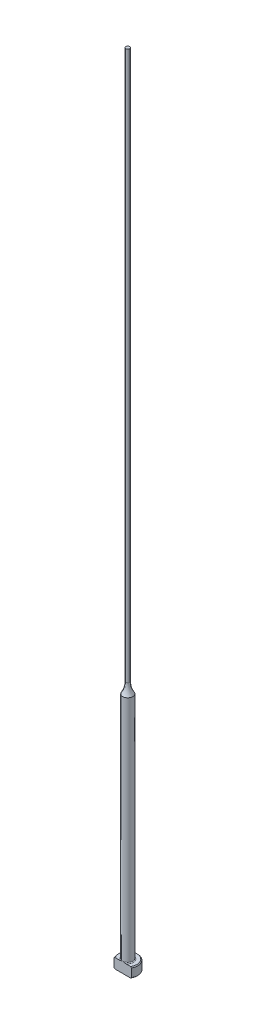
ISO-10303-21;
HEADER;
FILE_DESCRIPTION(('STEP AP214'),'2;1');
FILE_NAME('part.step','',(''),(''),'','','');
FILE_SCHEMA(('AUTOMOTIVE_DESIGN { 1 0 10303 214 1 1 1 1 }'));
ENDSEC;
DATA;
#1=APPLICATION_CONTEXT('core data for automotive mechanical design processes');
#2=APPLICATION_PROTOCOL_DEFINITION('international standard','automotive_design',2000,#1);
#3=PRODUCT_CONTEXT('',#1,'mechanical');
#4=PRODUCT('Part','Part','',(#3));
#5=PRODUCT_RELATED_PRODUCT_CATEGORY('part','',(#4));
#6=PRODUCT_DEFINITION_FORMATION('','',#4);
#7=PRODUCT_DEFINITION_CONTEXT('part definition',#1,'design');
#8=PRODUCT_DEFINITION('design','',#6,#7);
#9=PRODUCT_DEFINITION_SHAPE('','',#8);
#10=(LENGTH_UNIT() NAMED_UNIT(*) SI_UNIT(.MILLI.,.METRE.));
#11=(NAMED_UNIT(*) PLANE_ANGLE_UNIT() SI_UNIT($,.RADIAN.));
#12=(NAMED_UNIT(*) SI_UNIT($,.STERADIAN.) SOLID_ANGLE_UNIT());
#13=UNCERTAINTY_MEASURE_WITH_UNIT(LENGTH_MEASURE(1.E-05),#10,'distance_accuracy_value','');
#14=(GEOMETRIC_REPRESENTATION_CONTEXT(3) GLOBAL_UNCERTAINTY_ASSIGNED_CONTEXT((#13)) GLOBAL_UNIT_ASSIGNED_CONTEXT((#10,
#11,#12)) REPRESENTATION_CONTEXT('',''));
#15=CARTESIAN_POINT('',(0.,0.,0.));
#16=DIRECTION('',(0.,0.,1.));
#17=DIRECTION('',(1.,0.,0.));
#18=AXIS2_PLACEMENT_3D('',#15,#16,#17);
#19=CARTESIAN_POINT('',(-0.594359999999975,254.,0.));
#20=DIRECTION('',(0.,1.,0.));
#21=DIRECTION('',(0.,0.,1.));
#22=AXIS2_PLACEMENT_3D('',#19,#20,#21);
#23=PLANE('',#22);
#24=CARTESIAN_POINT('',(0.,254.,0.));
#25=DIRECTION('',(0.,1.,0.));
#26=DIRECTION('',(0.,0.,1.));
#27=AXIS2_PLACEMENT_3D('',#24,#25,#26);
#28=CIRCLE('',#27,0.594359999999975);
#29=CARTESIAN_POINT('',(0.,254.,0.594359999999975));
#30=VERTEX_POINT('',#29);
#31=EDGE_CURVE('E169',#30,#30,#28,.T.);
#32=ORIENTED_EDGE('',*,*,#31,.T.);
#33=EDGE_LOOP('',(#32));
#34=FACE_BOUND('',#33,.T.);
#35=ADVANCED_FACE('F37',(#34),#23,.T.);
#36=CARTESIAN_POINT('',(0.,259.958771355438,0.));
#37=DIRECTION('',(0.,1.,0.));
#38=DIRECTION('',(0.,0.,1.));
#39=AXIS2_PLACEMENT_3D('',#36,#37,#38);
#40=CYLINDRICAL_SURFACE('',#39,0.594359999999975);
#41=CARTESIAN_POINT('',(0.,79.6097728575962,0.));
#42=DIRECTION('',(0.,1.,0.));
#43=DIRECTION('',(0.,0.,1.));
#44=AXIS2_PLACEMENT_3D('',#41,#42,#43);
#45=CIRCLE('',#44,0.594359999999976);
#46=CARTESIAN_POINT('',(0.,79.6097728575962,0.594359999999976));
#47=VERTEX_POINT('',#46);
#48=EDGE_CURVE('E172',#47,#47,#45,.T.);
#49=ORIENTED_EDGE('',*,*,#48,.T.);
#50=EDGE_LOOP('',(#49));
#51=FACE_BOUND('',#50,.T.);
#52=ORIENTED_EDGE('',*,*,#31,.F.);
#53=EDGE_LOOP('',(#52));
#54=FACE_BOUND('',#53,.T.);
#55=ADVANCED_FACE('F160',(#51,#54),#40,.T.);
#56=CARTESIAN_POINT('',(0.,79.6097728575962,0.));
#57=DIRECTION('',(0.,1.,0.));
#58=DIRECTION('',(0.,0.,1.));
#59=AXIS2_PLACEMENT_3D('',#56,#57,#58);
#60=TOROIDAL_SURFACE('',#59,6.94435999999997,6.35);
#61=CARTESIAN_POINT('',(0.,76.2,0.));
#62=DIRECTION('',(0.,1.,0.));
#63=DIRECTION('',(0.,0.,1.));
#64=AXIS2_PLACEMENT_3D('',#61,#62,#63);
#65=CIRCLE('',#64,1.58749999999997);
#66=CARTESIAN_POINT('',(0.,76.2,1.58749999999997));
#67=VERTEX_POINT('',#66);
#68=EDGE_CURVE('E100',#67,#67,#65,.T.);
#69=ORIENTED_EDGE('',*,*,#68,.T.);
#70=EDGE_LOOP('',(#69));
#71=FACE_BOUND('',#70,.T.);
#72=ORIENTED_EDGE('',*,*,#48,.F.);
#73=EDGE_LOOP('',(#72));
#74=FACE_BOUND('',#73,.T.);
#75=ADVANCED_FACE('F165',(#71,#74),#60,.F.);
#76=CARTESIAN_POINT('',(0.,259.958771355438,0.));
#77=DIRECTION('',(0.,1.,0.));
#78=DIRECTION('',(0.,0.,1.));
#79=AXIS2_PLACEMENT_3D('',#76,#77,#78);
#80=CYLINDRICAL_SURFACE('',#79,1.58749999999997);
#81=CARTESIAN_POINT('',(0.,3.42900000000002,0.));
#82=DIRECTION('',(0.,1.,0.));
#83=DIRECTION('',(0.,0.,1.));
#84=AXIS2_PLACEMENT_3D('',#81,#82,#83);
#85=CIRCLE('',#84,1.58749999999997);
#86=CARTESIAN_POINT('',(0.,3.42900000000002,1.58749999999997));
#87=VERTEX_POINT('',#86);
#88=EDGE_CURVE('E109',#87,#87,#85,.T.);
#89=ORIENTED_EDGE('',*,*,#88,.T.);
#90=EDGE_LOOP('',(#89));
#91=FACE_BOUND('',#90,.T.);
#92=ORIENTED_EDGE('',*,*,#68,.F.);
#93=EDGE_LOOP('',(#92));
#94=FACE_BOUND('',#93,.T.);
#95=ADVANCED_FACE('F192',(#91,#94),#80,.T.);
#96=CARTESIAN_POINT('',(-3.17499999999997,3.175,0.));
#97=DIRECTION('',(0.,1.,0.));
#98=DIRECTION('',(0.,0.,1.));
#99=AXIS2_PLACEMENT_3D('',#96,#97,#98);
#100=PLANE('',#99);
#101=DIRECTION('',(-1.,0.,0.));
#102=VECTOR('',#101,1.);
#103=CARTESIAN_POINT('',(-3.17499999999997,3.175,1.58749999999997));
#104=LINE('',#103,#102);
#105=CARTESIAN_POINT('',(2.45195529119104,3.175,1.58749999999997));
#106=VERTEX_POINT('',#105);
#107=CARTESIAN_POINT('',(0.933255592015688,3.175,1.58749999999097));
#108=VERTEX_POINT('',#107);
#109=EDGE_CURVE('E58',#106,#108,#104,.T.);
#110=ORIENTED_EDGE('',*,*,#109,.F.);
#111=CARTESIAN_POINT('',(0.,3.175,0.));
#112=DIRECTION('',(0.,1.,0.));
#113=DIRECTION('',(0.,0.,1.));
#114=AXIS2_PLACEMENT_3D('',#111,#112,#113);
#115=CIRCLE('',#114,2.92099999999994);
#116=CARTESIAN_POINT('',(-2.45195529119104,3.175,1.58749999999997));
#117=VERTEX_POINT('',#116);
#118=EDGE_CURVE('E171',#106,#117,#115,.T.);
#119=ORIENTED_EDGE('',*,*,#118,.T.);
#120=CARTESIAN_POINT('',(-0.933255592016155,3.17500000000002,1.58749999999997));
#121=VERTEX_POINT('',#120);
#122=EDGE_CURVE('E140',#121,#117,#104,.T.);
#123=ORIENTED_EDGE('',*,*,#122,.F.);
#124=CARTESIAN_POINT('',(0.,3.175,0.));
#125=DIRECTION('',(0.,1.,0.));
#126=DIRECTION('',(0.,0.,1.));
#127=AXIS2_PLACEMENT_3D('',#124,#125,#126);
#128=CIRCLE('',#127,1.84149999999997);
#129=EDGE_CURVE('E113',#121,#108,#128,.F.);
#130=ORIENTED_EDGE('',*,*,#129,.T.);
#131=EDGE_LOOP('',(#110,#119,#123,#130));
#132=FACE_BOUND('',#131,.T.);
#133=ADVANCED_FACE('F189',(#132),#100,.T.);
#134=CARTESIAN_POINT('',(0.,259.958771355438,0.));
#135=DIRECTION('',(0.,1.,0.));
#136=DIRECTION('',(0.,0.,1.));
#137=AXIS2_PLACEMENT_3D('',#134,#135,#136);
#138=CYLINDRICAL_SURFACE('',#137,3.17499999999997);
#139=DIRECTION('',(0.,-1.,0.));
#140=VECTOR('',#139,1.);
#141=CARTESIAN_POINT('',(-2.74963065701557,254.,1.58749999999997));
#142=LINE('',#141,#140);
#143=CARTESIAN_POINT('',(-2.74963065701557,2.92100000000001,1.58749999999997));
#144=VERTEX_POINT('',#143);
#145=CARTESIAN_POINT('',(-2.74963065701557,0.253999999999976,1.58749999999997));
#146=VERTEX_POINT('',#145);
#147=EDGE_CURVE('E95',#144,#146,#142,.T.);
#148=ORIENTED_EDGE('',*,*,#147,.F.);
#149=CARTESIAN_POINT('',(0.,2.92100000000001,0.));
#150=DIRECTION('',(0.,1.,0.));
#151=DIRECTION('',(0.,0.,1.));
#152=AXIS2_PLACEMENT_3D('',#149,#150,#151);
#153=CIRCLE('',#152,3.17499999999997);
#154=CARTESIAN_POINT('',(2.74963065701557,2.92100000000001,1.58749999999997));
#155=VERTEX_POINT('',#154);
#156=EDGE_CURVE('E110',#144,#155,#153,.F.);
#157=ORIENTED_EDGE('',*,*,#156,.T.);
#158=DIRECTION('',(0.,-1.,0.));
#159=VECTOR('',#158,1.);
#160=CARTESIAN_POINT('',(2.74963065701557,254.,1.58749999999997));
#161=LINE('',#160,#159);
#162=CARTESIAN_POINT('',(2.74963065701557,0.253999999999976,1.58749999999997));
#163=VERTEX_POINT('',#162);
#164=EDGE_CURVE('E182',#155,#163,#161,.T.);
#165=ORIENTED_EDGE('',*,*,#164,.T.);
#166=CARTESIAN_POINT('',(0.,0.253999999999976,0.));
#167=DIRECTION('',(0.,-1.,0.));
#168=DIRECTION('',(0.,0.,-1.));
#169=AXIS2_PLACEMENT_3D('',#166,#167,#168);
#170=CIRCLE('',#169,3.17499999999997);
#171=EDGE_CURVE('E116',#163,#146,#170,.F.);
#172=ORIENTED_EDGE('',*,*,#171,.T.);
#173=EDGE_LOOP('',(#148,#157,#165,#172));
#174=FACE_BOUND('',#173,.T.);
#175=ADVANCED_FACE('F180',(#174),#138,.T.);
#176=CARTESIAN_POINT('',(0.,0.,0.));
#177=DIRECTION('',(0.,-1.,0.));
#178=DIRECTION('',(0.,0.,-1.));
#179=AXIS2_PLACEMENT_3D('',#176,#177,#178);
#180=PLANE('',#179);
#181=DIRECTION('',(1.,0.,0.));
#182=VECTOR('',#181,1.);
#183=CARTESIAN_POINT('',(-2.74963065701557,0.,1.58749999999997));
#184=LINE('',#183,#182);
#185=CARTESIAN_POINT('',(-2.45195529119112,0.,1.58749999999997));
#186=VERTEX_POINT('',#185);
#187=CARTESIAN_POINT('',(2.45195529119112,0.,1.58749999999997));
#188=VERTEX_POINT('',#187);
#189=EDGE_CURVE('E92',#186,#188,#184,.T.);
#190=ORIENTED_EDGE('',*,*,#189,.F.);
#191=CARTESIAN_POINT('',(0.,0.,0.));
#192=DIRECTION('',(0.,-1.,0.));
#193=DIRECTION('',(0.,0.,-1.));
#194=AXIS2_PLACEMENT_3D('',#191,#192,#193);
#195=CIRCLE('',#194,2.92100000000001);
#196=EDGE_CURVE('E106',#186,#188,#195,.T.);
#197=ORIENTED_EDGE('',*,*,#196,.T.);
#198=EDGE_LOOP('',(#190,#197));
#199=FACE_BOUND('',#198,.T.);
#200=ADVANCED_FACE('F105',(#199),#180,.T.);
#201=CARTESIAN_POINT('',(0.,3.17499999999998,0.));
#202=DIRECTION('',(0.,-1.,0.));
#203=DIRECTION('',(0.,0.,-1.));
#204=AXIS2_PLACEMENT_3D('',#201,#202,#203);
#205=CONICAL_SURFACE('',#204,2.92099999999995,0.785398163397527);
#206=CARTESIAN_POINT('',(2.75033065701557,2.9203937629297,1.58749999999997));
#207=CARTESIAN_POINT('',(2.66887796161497,2.99091042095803,1.58749999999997));
#208=CARTESIAN_POINT('',(2.58705989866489,3.0610138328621,1.58749999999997));
#209=CARTESIAN_POINT('',(2.42241022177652,3.20009957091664,1.58749999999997));
#210=CARTESIAN_POINT('',(2.33957813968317,3.26908134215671,1.58749999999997));
#211=CARTESIAN_POINT('',(2.17073968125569,3.40716024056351,1.58749999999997));
#212=CARTESIAN_POINT('',(2.08470440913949,3.47622217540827,1.58749999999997));
#213=CARTESIAN_POINT('',(1.91099881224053,3.61222325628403,1.58749999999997));
#214=CARTESIAN_POINT('',(1.82332890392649,3.67916293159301,1.58749999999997));
#215=CARTESIAN_POINT('',(1.64569223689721,3.8102066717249,1.58749999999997));
#216=CARTESIAN_POINT('',(1.55572245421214,3.8743066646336,1.58749999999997));
#217=CARTESIAN_POINT('',(1.37280394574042,3.99833089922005,1.58749999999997));
#218=CARTESIAN_POINT('',(1.27985285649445,4.05825170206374,1.58749999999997));
#219=CARTESIAN_POINT('',(1.09086561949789,4.17130826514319,1.58749999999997));
#220=CARTESIAN_POINT('',(0.994859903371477,4.22449421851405,1.58749999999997));
#221=CARTESIAN_POINT('',(0.798114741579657,4.32122233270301,1.58749999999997));
#222=CARTESIAN_POINT('',(0.697384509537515,4.36478238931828,1.58749999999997));
#223=CARTESIAN_POINT('',(0.541185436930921,4.41951656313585,1.58749999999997));
#224=CARTESIAN_POINT('',(0.487627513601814,4.43611950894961,1.58749999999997));
#225=CARTESIAN_POINT('',(0.379267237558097,4.46466012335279,1.58749999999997));
#226=CARTESIAN_POINT('',(0.324465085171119,4.4765985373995,1.58749999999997));
#227=CARTESIAN_POINT('',(0.214272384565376,4.49501904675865,1.58749999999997));
#228=CARTESIAN_POINT('',(0.158887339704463,4.50153345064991,1.58749999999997));
#229=CARTESIAN_POINT('',(0.047736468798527,4.5087502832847,1.58749999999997));
#230=CARTESIAN_POINT('',(-0.00802931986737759,4.50945327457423,1.58749999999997));
#231=CARTESIAN_POINT('',(-0.119372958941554,4.50499163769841,1.58749999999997));
#232=CARTESIAN_POINT('',(-0.174950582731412,4.49982147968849,1.58749999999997));
#233=CARTESIAN_POINT('',(-0.285312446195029,4.48399101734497,1.58749999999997));
#234=CARTESIAN_POINT('',(-0.340096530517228,4.4733296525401,1.58749999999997));
#235=CARTESIAN_POINT('',(-0.448865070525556,4.44711334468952,1.58749999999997));
#236=CARTESIAN_POINT('',(-0.502841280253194,4.43152477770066,1.58749999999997));
#237=CARTESIAN_POINT('',(-0.609429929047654,4.39628553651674,1.58749999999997));
#238=CARTESIAN_POINT('',(-0.662042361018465,4.37663484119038,1.58749999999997));
#239=CARTESIAN_POINT('',(-0.778129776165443,4.32902110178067,1.58749999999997));
#240=CARTESIAN_POINT('',(-0.841245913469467,4.30019026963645,1.58749999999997));
#241=CARTESIAN_POINT('',(-0.96559457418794,4.23868811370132,1.58749999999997));
#242=CARTESIAN_POINT('',(-1.02682597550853,4.20601455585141,1.58749999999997));
#243=CARTESIAN_POINT('',(-1.14774341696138,4.13769010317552,1.58749999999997));
#244=CARTESIAN_POINT('',(-1.20742632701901,4.10203371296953,1.58749999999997));
#245=CARTESIAN_POINT('',(-1.32539130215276,4.02846531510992,1.58749999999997));
#246=CARTESIAN_POINT('',(-1.38367308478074,3.99055285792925,1.58749999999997));
#247=CARTESIAN_POINT('',(-1.55734442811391,3.87382704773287,1.58749999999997));
#248=CARTESIAN_POINT('',(-1.6709584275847,3.79237897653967,1.58749999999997));
#249=CARTESIAN_POINT('',(-1.89475235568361,3.62521862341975,1.58749999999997));
#250=CARTESIAN_POINT('',(-2.00493591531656,3.53951111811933,1.58749999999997));
#251=CARTESIAN_POINT('',(-2.22248693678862,3.36554942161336,1.58749999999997));
#252=CARTESIAN_POINT('',(-2.32986450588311,3.27730782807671,1.58749999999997));
#253=CARTESIAN_POINT('',(-2.48909538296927,3.14389342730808,1.58749999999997));
#254=CARTESIAN_POINT('',(-2.54159338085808,3.09948435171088,1.58749999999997));
#255=CARTESIAN_POINT('',(-2.64622282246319,3.01024124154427,1.58749999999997));
#256=CARTESIAN_POINT('',(-2.69835428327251,2.96540722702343,1.58749999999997));
#257=CARTESIAN_POINT('',(-2.75033065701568,2.92039376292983,1.58749999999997));
#258=B_SPLINE_CURVE_WITH_KNOTS('',3,(#206,#207,#208,#209,#210,#211,#212,#213,#214,#215,#216,
#217,#218,#219,#220,#221,#222,#223,#224,#225,#226,#227,#228,#229,#230,#231,#232,#233,#234,#235,
#236,#237,#238,#239,#240,#241,#242,#243,#244,#245,#246,#247,#248,#249,#250,#251,#252,#253,#254,
#255,#256,#257),.UNSPECIFIED.,.F.,.F.,(4,2,2,2,2,2,2,2,2,2,2,2,2,2,2,2,2,2,2,2,2,2,2,2,2,4),(0.,
0.323216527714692,0.64658837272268,0.97753957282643,1.30840757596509,1.639735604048,
1.97133312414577,2.30029221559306,2.62863448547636,2.79668277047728,2.96470418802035,
3.13171746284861,3.29871457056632,3.46586904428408,3.63305581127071,3.80140905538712,
3.96976317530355,4.17775353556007,4.38586541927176,4.59436953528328,4.80291533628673,
5.22209642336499,5.64081759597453,6.0577303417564,6.26401477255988,6.47028951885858),.UNSPECIFIED.);
#259=EDGE_CURVE('E63',#155,#106,#258,.T.);
#260=ORIENTED_EDGE('',*,*,#259,.F.);
#261=ORIENTED_EDGE('',*,*,#156,.F.);
#262=EDGE_CURVE('E133',#117,#144,#258,.T.);
#263=ORIENTED_EDGE('',*,*,#262,.F.);
#264=ORIENTED_EDGE('',*,*,#118,.F.);
#265=EDGE_LOOP('',(#260,#261,#263,#264));
#266=FACE_BOUND('',#265,.T.);
#267=ADVANCED_FACE('F147',(#266),#205,.T.);
#268=CARTESIAN_POINT('',(0.,0.253999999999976,0.));
#269=DIRECTION('',(0.,1.,0.));
#270=DIRECTION('',(0.,0.,1.));
#271=AXIS2_PLACEMENT_3D('',#268,#269,#270);
#272=CONICAL_SURFACE('',#271,3.17499999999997,0.785398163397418);
#273=CARTESIAN_POINT('',(-2.75033065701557,0.254606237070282,1.58749999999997));
#274=CARTESIAN_POINT('',(-2.66887796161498,0.184089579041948,1.58749999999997));
#275=CARTESIAN_POINT('',(-2.58705989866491,0.113986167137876,1.58749999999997));
#276=CARTESIAN_POINT('',(-2.42241022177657,-0.0250995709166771,1.58749999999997));
#277=CARTESIAN_POINT('',(-2.33957813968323,-0.0940813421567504,1.58749999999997));
#278=CARTESIAN_POINT('',(-2.17073968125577,-0.232160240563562,1.58749999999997));
#279=CARTESIAN_POINT('',(-2.08470440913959,-0.301222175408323,1.58749999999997));
#280=CARTESIAN_POINT('',(-1.91099881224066,-0.437223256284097,1.58749999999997));
#281=CARTESIAN_POINT('',(-1.82332890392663,-0.50416293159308,1.58749999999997));
#282=CARTESIAN_POINT('',(-1.64569223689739,-0.635206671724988,1.58749999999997));
#283=CARTESIAN_POINT('',(-1.55572245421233,-0.699306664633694,1.58749999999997));
#284=CARTESIAN_POINT('',(-1.37280394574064,-0.823330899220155,1.58749999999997));
#285=CARTESIAN_POINT('',(-1.27985285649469,-0.883251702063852,1.58749999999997));
#286=CARTESIAN_POINT('',(-1.09086561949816,-0.996308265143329,1.58749999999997));
#287=CARTESIAN_POINT('',(-0.994859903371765,-1.0494942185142,1.58749999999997));
#288=CARTESIAN_POINT('',(-0.798114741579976,-1.14622233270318,1.58749999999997));
#289=CARTESIAN_POINT('',(-0.697384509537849,-1.18978238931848,1.58749999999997));
#290=CARTESIAN_POINT('',(-0.54118543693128,-1.24451656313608,1.58749999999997));
#291=CARTESIAN_POINT('',(-0.487627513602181,-1.26111950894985,1.58749999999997));
#292=CARTESIAN_POINT('',(-0.379267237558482,-1.28966012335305,1.58749999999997));
#293=CARTESIAN_POINT('',(-0.324465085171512,-1.30159853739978,1.58749999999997));
#294=CARTESIAN_POINT('',(-0.214272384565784,-1.32001904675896,1.58749999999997));
#295=CARTESIAN_POINT('',(-0.158887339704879,-1.32653345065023,1.58749999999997));
#296=CARTESIAN_POINT('',(-0.0477364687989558,-1.33375028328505,1.58749999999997));
#297=CARTESIAN_POINT('',(0.00802931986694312,-1.33445327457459,1.58749999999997));
#298=CARTESIAN_POINT('',(0.119372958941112,-1.32999163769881,1.58749999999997));
#299=CARTESIAN_POINT('',(0.174950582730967,-1.3248214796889,1.58749999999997));
#300=CARTESIAN_POINT('',(0.28531244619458,-1.30899101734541,1.58749999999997));
#301=CARTESIAN_POINT('',(0.340096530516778,-1.29832965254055,1.58749999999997));
#302=CARTESIAN_POINT('',(0.448865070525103,-1.27211334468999,1.58749999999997));
#303=CARTESIAN_POINT('',(0.50284128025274,-1.25652477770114,1.58749999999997));
#304=CARTESIAN_POINT('',(0.609429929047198,-1.22128553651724,1.58749999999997));
#305=CARTESIAN_POINT('',(0.662042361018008,-1.20163484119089,1.58749999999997));
#306=CARTESIAN_POINT('',(0.778129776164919,-1.15402110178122,1.58749999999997));
#307=CARTESIAN_POINT('',(0.841245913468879,-1.12519026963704,1.58749999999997));
#308=CARTESIAN_POINT('',(0.965594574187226,-1.06368811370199,1.58749999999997));
#309=CARTESIAN_POINT('',(1.02682597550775,-1.03101455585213,1.58749999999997));
#310=CARTESIAN_POINT('',(1.14774341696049,-0.962690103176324,1.58749999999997));
#311=CARTESIAN_POINT('',(1.20742632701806,-0.927033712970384,1.58749999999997));
#312=CARTESIAN_POINT('',(1.32539130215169,-0.85346531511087,1.58749999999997));
#313=CARTESIAN_POINT('',(1.38367308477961,-0.815552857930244,1.58749999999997));
#314=CARTESIAN_POINT('',(1.5573444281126,-0.698827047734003,1.58749999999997));
#315=CARTESIAN_POINT('',(1.67095842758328,-0.617378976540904,1.58749999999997));
#316=CARTESIAN_POINT('',(1.89475235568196,-0.45021862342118,1.58749999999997));
#317=CARTESIAN_POINT('',(2.0049359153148,-0.364511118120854,1.58749999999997));
#318=CARTESIAN_POINT('',(2.22248693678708,-0.19054942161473,1.58749999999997));
#319=CARTESIAN_POINT('',(2.3298645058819,-0.102307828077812,1.58749999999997));
#320=CARTESIAN_POINT('',(2.48909538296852,0.0311065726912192,1.58749999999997));
#321=CARTESIAN_POINT('',(2.54159338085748,0.0755156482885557,1.58749999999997));
#322=CARTESIAN_POINT('',(2.64622282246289,0.16475875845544,1.58749999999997));
#323=CARTESIAN_POINT('',(2.69835428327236,0.209592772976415,1.58749999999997));
#324=CARTESIAN_POINT('',(2.75033065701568,0.254606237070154,1.58749999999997));
#325=B_SPLINE_CURVE_WITH_KNOTS('',3,(#273,#274,#275,#276,#277,#278,#279,#280,#281,#282,#283,
#284,#285,#286,#287,#288,#289,#290,#291,#292,#293,#294,#295,#296,#297,#298,#299,#300,#301,#302,
#303,#304,#305,#306,#307,#308,#309,#310,#311,#312,#313,#314,#315,#316,#317,#318,#319,#320,#321,
#322,#323,#324),.UNSPECIFIED.,.F.,.F.,(4,2,2,2,2,2,2,2,2,2,2,2,2,2,2,2,2,2,2,2,2,2,2,2,2,4),(0.,
0.323216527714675,0.646588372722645,0.977539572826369,1.308407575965,1.63973560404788,
1.97133312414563,2.3002922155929,2.62863448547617,2.79668277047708,2.96470418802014,
3.13171746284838,3.29871457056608,3.46586904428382,3.63305581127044,3.80140905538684,
3.96976317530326,4.17775353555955,4.38586541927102,4.59436953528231,4.80291533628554,
5.22209642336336,5.64081759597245,6.05773034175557,6.26401477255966,6.47028951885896),.UNSPECIFIED.);
#326=EDGE_CURVE('E89',#146,#186,#325,.T.);
#327=ORIENTED_EDGE('',*,*,#326,.F.);
#328=ORIENTED_EDGE('',*,*,#171,.F.);
#329=EDGE_CURVE('E101',#188,#163,#325,.T.);
#330=ORIENTED_EDGE('',*,*,#329,.F.);
#331=ORIENTED_EDGE('',*,*,#196,.F.);
#332=EDGE_LOOP('',(#327,#328,#330,#331));
#333=FACE_BOUND('',#332,.T.);
#334=ADVANCED_FACE('F108',(#333),#272,.T.);
#335=CARTESIAN_POINT('',(0.,3.42900000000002,0.));
#336=DIRECTION('',(0.,1.,0.));
#337=DIRECTION('',(0.,0.,1.));
#338=AXIS2_PLACEMENT_3D('',#335,#336,#337);
#339=TOROIDAL_SURFACE('',#338,1.84149999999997,0.254);
#340=ORIENTED_EDGE('',*,*,#129,.F.);
#341=CARTESIAN_POINT('',(0.,3.42900000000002,1.58749999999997));
#342=CARTESIAN_POINT('',(-1.92205025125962E-10,3.42900057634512,1.58749999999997));
#343=CARTESIAN_POINT('',(-1.22611614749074E-07,3.42900115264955,1.58749999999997));
#344=CARTESIAN_POINT('',(-5.0967636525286E-07,3.42900226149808,1.58749999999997));
#345=CARTESIAN_POINT('',(-7.78176328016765E-07,3.42900279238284,1.58749999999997));
#346=CARTESIAN_POINT('',(-1.42307272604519E-06,3.42900385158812,1.58749999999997));
#347=CARTESIAN_POINT('',(-1.80713867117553E-06,3.42900437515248,1.58749999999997));
#348=CARTESIAN_POINT('',(-2.63494846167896E-06,3.4290053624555,1.58749999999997));
#349=CARTESIAN_POINT('',(-3.07814756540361E-06,3.42900582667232,1.58749999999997));
#350=CARTESIAN_POINT('',(-4.66897357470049E-06,3.4290073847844,1.58749999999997));
#351=CARTESIAN_POINT('',(-5.89404908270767E-06,3.42900840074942,1.58749999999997));
#352=CARTESIAN_POINT('',(-8.42427511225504E-06,3.42901020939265,1.58749999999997));
#353=CARTESIAN_POINT('',(-9.72480574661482E-06,3.42901100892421,1.58749999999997));
#354=CARTESIAN_POINT('',(-1.48060601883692E-05,3.42901401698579,1.58749999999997));
#355=CARTESIAN_POINT('',(-1.86838281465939E-05,3.42901606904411,1.58749999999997));
#356=CARTESIAN_POINT('',(-2.63261117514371E-05,3.42901942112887,1.58749999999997));
#357=CARTESIAN_POINT('',(-3.00687417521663E-05,3.42902077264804,1.58749999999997));
#358=CARTESIAN_POINT('',(-4.60276298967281E-05,3.42902652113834,1.58749999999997));
#359=CARTESIAN_POINT('',(-5.8247019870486E-05,3.4290308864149,1.58749999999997));
#360=CARTESIAN_POINT('',(-8.11070097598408E-05,3.42903788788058,1.58749999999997));
#361=CARTESIAN_POINT('',(-9.16953114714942E-05,3.42904068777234,1.58749999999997));
#362=CARTESIAN_POINT('',(-0.000168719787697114,3.4290628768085,1.58749999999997));
#363=CARTESIAN_POINT('',(-0.00023219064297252,3.42909118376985,1.58749999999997));
#364=CARTESIAN_POINT('',(-0.000479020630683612,3.42919723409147,1.58749999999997));
#365=CARTESIAN_POINT('',(-0.000664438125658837,3.42926834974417,1.58749999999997));
#366=CARTESIAN_POINT('',(-0.00138448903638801,3.42954862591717,1.58749999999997));
#367=CARTESIAN_POINT('',(-0.00191701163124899,3.42976473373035,1.58749999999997));
#368=CARTESIAN_POINT('',(-0.00409774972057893,3.43064550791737,1.58749999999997));
#369=CARTESIAN_POINT('',(-0.00574830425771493,3.43130231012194,1.58749999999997));
#370=CARTESIAN_POINT('',(-0.0289985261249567,3.44055947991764,1.58749999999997));
#371=CARTESIAN_POINT('',(-0.0505816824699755,3.44921674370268,1.58749999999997));
#372=CARTESIAN_POINT('',(-0.0929947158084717,3.46610702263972,1.58749999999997));
#373=CARTESIAN_POINT('',(-0.11382315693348,3.47434394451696,1.58749999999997));
#374=CARTESIAN_POINT('',(-0.1579563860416,3.49164606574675,1.58749999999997));
#375=CARTESIAN_POINT('',(-0.181267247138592,3.5006960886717,1.58749999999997));
#376=CARTESIAN_POINT('',(-0.228222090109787,3.51863224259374,1.58749999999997));
#377=CARTESIAN_POINT('',(-0.251867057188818,3.52751579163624,1.58749999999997));
#378=CARTESIAN_POINT('',(-0.310512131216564,3.54905503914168,1.58749999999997));
#379=CARTESIAN_POINT('',(-0.345588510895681,3.56150550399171,1.58749999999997));
#380=CARTESIAN_POINT('',(-0.415278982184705,3.5850302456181,1.58749999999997));
#381=CARTESIAN_POINT('',(-0.449884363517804,3.59613012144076,1.58749999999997));
#382=CARTESIAN_POINT('',(-0.524471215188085,3.61841679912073,1.58749999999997));
#383=CARTESIAN_POINT('',(-0.564517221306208,3.62939137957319,1.58749999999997));
#384=CARTESIAN_POINT('',(-0.645529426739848,3.6489746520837,1.58749999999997));
#385=CARTESIAN_POINT('',(-0.686500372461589,3.65756417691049,1.58749999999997));
#386=CARTESIAN_POINT('',(-0.771546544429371,3.67188287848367,1.58749999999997));
#387=CARTESIAN_POINT('',(-0.815658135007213,3.67740449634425,1.58749999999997));
#388=CARTESIAN_POINT('',(-0.904117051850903,3.68344603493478,1.58749999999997));
#389=CARTESIAN_POINT('',(-0.948462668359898,3.68398638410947,1.58749999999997));
#390=CARTESIAN_POINT('',(-1.02531896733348,3.67901051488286,1.58749999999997));
#391=CARTESIAN_POINT('',(-1.05792141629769,3.67502604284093,1.58749999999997));
#392=CARTESIAN_POINT('',(-1.12184393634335,3.66230832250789,1.58749999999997));
#393=CARTESIAN_POINT('',(-1.1531753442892,3.65363950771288,1.58749999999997));
#394=CARTESIAN_POINT('',(-1.19946468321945,3.6356384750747,1.58749999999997));
#395=CARTESIAN_POINT('',(-1.21526783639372,3.62848492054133,1.58749999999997));
#396=CARTESIAN_POINT('',(-1.24583726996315,3.61212937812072,1.58749999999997));
#397=CARTESIAN_POINT('',(-1.26060215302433,3.60292469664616,1.58749999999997));
#398=CARTESIAN_POINT('',(-1.28575815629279,3.58421518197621,1.58749999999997));
#399=CARTESIAN_POINT('',(-1.29644383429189,3.57510998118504,1.58749999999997));
#400=CARTESIAN_POINT('',(-1.31623154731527,3.55531539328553,1.58749999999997));
#401=CARTESIAN_POINT('',(-1.32533681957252,3.54462932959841,1.58749999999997));
#402=CARTESIAN_POINT('',(-1.33941140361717,3.52450022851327,1.58749999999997));
#403=CARTESIAN_POINT('',(-1.34484814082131,3.51538553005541,1.58749999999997));
#404=CARTESIAN_POINT('',(-1.35416329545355,3.49638544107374,1.58749999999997));
#405=CARTESIAN_POINT('',(-1.35804267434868,3.48650053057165,1.58749999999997));
#406=CARTESIAN_POINT('',(-1.36398436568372,3.46611321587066,1.58749999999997));
#407=CARTESIAN_POINT('',(-1.36603350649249,3.45560690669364,1.58749999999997));
#408=CARTESIAN_POINT('',(-1.3680840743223,3.43439627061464,1.58749999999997));
#409=CARTESIAN_POINT('',(-1.36808648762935,3.42369204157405,1.58749999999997));
#410=CARTESIAN_POINT('',(-1.36616208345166,3.40366716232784,1.58749999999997));
#411=CARTESIAN_POINT('',(-1.36444960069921,3.39432493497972,1.58749999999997));
#412=CARTESIAN_POINT('',(-1.35953338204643,3.37604480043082,1.58749999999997));
#413=CARTESIAN_POINT('',(-1.3563294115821,3.36710695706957,1.58749999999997));
#414=CARTESIAN_POINT('',(-1.34848006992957,3.34949697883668,1.58749999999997));
#415=CARTESIAN_POINT('',(-1.34378578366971,3.34084688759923,1.58749999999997));
#416=CARTESIAN_POINT('',(-1.33324445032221,3.32428742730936,1.58749999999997));
#417=CARTESIAN_POINT('',(-1.32739692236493,3.31637836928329,1.58749999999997));
#418=CARTESIAN_POINT('',(-1.31107304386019,3.29692878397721,1.58749999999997));
#419=CARTESIAN_POINT('',(-1.29989286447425,3.28597778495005,1.58749999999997));
#420=CARTESIAN_POINT('',(-1.27593566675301,3.26597490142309,1.58749999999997));
#421=CARTESIAN_POINT('',(-1.26315370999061,3.25692913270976,1.58749999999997));
#422=CARTESIAN_POINT('',(-1.22930733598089,3.23613976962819,1.58749999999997));
#423=CARTESIAN_POINT('',(-1.20751096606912,3.22559415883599,1.58749999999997));
#424=CARTESIAN_POINT('',(-1.16266144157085,3.20795356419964,1.58749999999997));
#425=CARTESIAN_POINT('',(-1.13960937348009,3.20085564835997,1.58749999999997));
#426=CARTESIAN_POINT('',(-1.07603916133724,3.18534571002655,1.58749999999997));
#427=CARTESIAN_POINT('',(-1.03486686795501,3.17965078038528,1.58749999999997));
#428=CARTESIAN_POINT('',(-0.95155815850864,3.1741711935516,1.58749999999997));
#429=CARTESIAN_POINT('',(-0.909417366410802,3.17449023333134,1.58749999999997));
#430=CARTESIAN_POINT('',(-0.811383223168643,3.18054602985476,1.58749999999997));
#431=CARTESIAN_POINT('',(-0.755610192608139,3.18806126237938,1.58749999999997));
#432=CARTESIAN_POINT('',(-0.644937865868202,3.20866626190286,1.58749999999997));
#433=CARTESIAN_POINT('',(-0.59004364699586,3.22178102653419,1.58749999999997));
#434=CARTESIAN_POINT('',(-0.485757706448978,3.25059077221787,1.58749999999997));
#435=CARTESIAN_POINT('',(-0.436281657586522,3.26598903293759,1.58749999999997));
#436=CARTESIAN_POINT('',(-0.338551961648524,3.29877502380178,1.58749999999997));
#437=CARTESIAN_POINT('',(-0.290291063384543,3.31614156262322,1.58749999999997));
#438=CARTESIAN_POINT('',(-0.225557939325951,3.34039762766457,1.58749999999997));
#439=CARTESIAN_POINT('',(-0.208874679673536,3.346735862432,1.58749999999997));
#440=CARTESIAN_POINT('',(-0.175123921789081,3.35969957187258,1.58749999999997));
#441=CARTESIAN_POINT('',(-0.158057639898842,3.36632823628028,1.58749999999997));
#442=CARTESIAN_POINT('',(-0.117638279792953,3.38214476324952,1.58749999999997));
#443=CARTESIAN_POINT('',(-0.094300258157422,3.39137029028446,1.58749999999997));
#444=CARTESIAN_POINT('',(-0.0497824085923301,3.40910304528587,1.58749999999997));
#445=CARTESIAN_POINT('',(-0.0285986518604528,3.41759960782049,1.58749999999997));
#446=CARTESIAN_POINT('',(-0.00575168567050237,3.42669635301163,1.58749999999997));
#447=CARTESIAN_POINT('',(-0.00410451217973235,3.42735181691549,1.58749999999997));
#448=CARTESIAN_POINT('',(-0.0019245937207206,3.42823223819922,1.58749999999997));
#449=CARTESIAN_POINT('',(-0.00138952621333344,3.42844937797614,1.58749999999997));
#450=CARTESIAN_POINT('',(-0.00066624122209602,3.42873091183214,1.58749999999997));
#451=CARTESIAN_POINT('',(-0.000480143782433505,3.42880228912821,1.58749999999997));
#452=CARTESIAN_POINT('',(-0.000232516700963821,3.42890868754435,1.58749999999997));
#453=CARTESIAN_POINT('',(-0.000168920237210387,3.42893705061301,1.58749999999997));
#454=CARTESIAN_POINT('',(-9.1752716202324E-05,3.42895927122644,1.58749999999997));
#455=CARTESIAN_POINT('',(-8.11550293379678E-05,3.42896207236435,1.58749999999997));
#456=CARTESIAN_POINT('',(-5.82743948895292E-05,3.42896908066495,1.58749999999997));
#457=CARTESIAN_POINT('',(-4.60440001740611E-05,3.42897345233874,1.58749999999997));
#458=CARTESIAN_POINT('',(-3.00727682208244E-05,3.42897920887,1.58749999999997));
#459=CARTESIAN_POINT('',(-2.63286807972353E-05,3.4289805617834,1.58749999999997));
#460=CARTESIAN_POINT('',(-1.86836529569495E-05,3.42898391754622,1.58749999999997));
#461=CARTESIAN_POINT('',(-1.48046517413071E-05,3.42898597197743,1.58749999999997));
#462=CARTESIAN_POINT('',(-9.72223943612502E-06,3.42898898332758,1.58749999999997));
#463=CARTESIAN_POINT('',(-8.42159649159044E-06,3.42898978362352,1.58749999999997));
#464=CARTESIAN_POINT('',(-5.89129729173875E-06,3.42899159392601,1.58749999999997));
#465=CARTESIAN_POINT('',(-4.6662686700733E-06,3.42899261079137,1.58749999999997));
#466=CARTESIAN_POINT('',(-3.07568803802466E-06,3.42899417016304,1.58749999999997));
#467=CARTESIAN_POINT('',(-2.63259565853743E-06,3.42899463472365,1.58749999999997));
#468=CARTESIAN_POINT('',(-1.80506085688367E-06,3.42899562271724,1.58749999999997));
#469=CARTESIAN_POINT('',(-1.4211638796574E-06,3.42899614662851,1.58749999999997));
#470=CARTESIAN_POINT('',(-7.76675643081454E-07,3.42899720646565,1.58749999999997));
#471=CARTESIAN_POINT('',(-5.08406487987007E-07,3.42899773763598,1.58749999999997));
#472=CARTESIAN_POINT('',(-1.21901887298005E-07,3.42899884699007,1.58749999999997));
#473=CARTESIAN_POINT('',(1.922515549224E-10,3.42899942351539,1.58749999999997));
#474=CARTESIAN_POINT('',(0.,3.42900000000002,1.58749999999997));
#475=B_SPLINE_CURVE_WITH_KNOTS('',3,(#341,#342,#343,#344,#345,#346,#347,#348,#349,#350,#351,
#352,#353,#354,#355,#356,#357,#358,#359,#360,#361,#362,#363,#364,#365,#366,#367,#368,#369,#370,
#371,#372,#373,#374,#375,#376,#377,#378,#379,#380,#381,#382,#383,#384,#385,#386,#387,#388,#389,
#390,#391,#392,#393,#394,#395,#396,#397,#398,#399,#400,#401,#402,#403,#404,#405,#406,#407,#408,
#409,#410,#411,#412,#413,#414,#415,#416,#417,#418,#419,#420,#421,#422,#423,#424,#425,#426,#427,
#428,#429,#430,#431,#432,#433,#434,#435,#436,#437,#438,#439,#440,#441,#442,#443,#444,#445,#446,
#447,#448,#449,#450,#451,#452,#453,#454,#455,#456,#457,#458,#459,#460,#461,#462,#463,#464,#465,
#466,#467,#468,#469,#470,#471,#472,#473,#474),.UNSPECIFIED.,.T.,.F.,(4,2,2,2,2,2,2,2,2,2,2,2,2,
2,2,2,2,2,2,2,2,2,2,2,2,2,2,2,2,2,2,2,2,2,2,2,2,2,2,2,2,2,2,2,2,2,2,2,2,2,2,2,2,2,2,2,2,2,2,2,2,
2,2,2,2,2,4),(0.,1.72815458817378E-06,3.5042925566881E-06,5.44431004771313E-06,
7.36755250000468E-06,1.21190896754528E-05,1.66953775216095E-05,2.98160400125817E-05,
4.17409564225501E-05,8.0660475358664E-05,0.000113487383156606,0.000321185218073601,
0.000917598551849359,0.00264089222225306,0.00797105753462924,0.0777276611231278,
0.144923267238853,0.219939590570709,0.295714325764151,0.407362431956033,0.516367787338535,
0.64087844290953,0.766362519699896,0.899536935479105,1.03216495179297,1.13045740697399,
1.22743103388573,1.27935899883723,1.33135556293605,1.37333248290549,1.41522237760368,
1.44693946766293,1.47863694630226,1.51056074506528,1.54246916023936,1.57083210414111,
1.59919951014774,1.62861579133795,1.65804436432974,1.70472658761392,1.75155645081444,
1.82378709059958,1.89595619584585,2.01995471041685,2.1460932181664,2.31447224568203,
2.48361094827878,2.63898919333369,2.79283011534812,2.84637031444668,2.90129461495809,
2.97658236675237,3.04504771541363,3.05036697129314,3.05209849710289,3.05269709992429,
3.05290520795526,3.05293806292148,3.05297701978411,3.05298895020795,3.05300207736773,
3.05300665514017,3.0530114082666,3.05301333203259,3.05301527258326,3.05301704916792,
3.05301877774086),.UNSPECIFIED.);
#476=EDGE_CURVE('E11',#121,#87,#475,.T.);
#477=ORIENTED_EDGE('',*,*,#476,.T.);
#478=ORIENTED_EDGE('',*,*,#88,.F.);
#479=CARTESIAN_POINT('',(0.,3.42900000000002,1.58749999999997));
#480=CARTESIAN_POINT('',(1.92204979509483E-10,3.42899942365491,1.58749999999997));
#481=CARTESIAN_POINT('',(1.22611614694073E-07,3.42899884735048,1.58749999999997));
#482=CARTESIAN_POINT('',(5.09676365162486E-07,3.42899773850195,1.58749999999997));
#483=CARTESIAN_POINT('',(7.78176327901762E-07,3.42899720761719,1.58749999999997));
#484=CARTESIAN_POINT('',(1.42307272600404E-06,3.42899614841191,1.58749999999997));
#485=CARTESIAN_POINT('',(1.8071386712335E-06,3.42899562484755,1.58749999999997));
#486=CARTESIAN_POINT('',(2.63494846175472E-06,3.42899463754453,1.58749999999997));
#487=CARTESIAN_POINT('',(3.07814756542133E-06,3.42899417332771,1.58749999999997));
#488=CARTESIAN_POINT('',(4.66897357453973E-06,3.42899261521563,1.58749999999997));
#489=CARTESIAN_POINT('',(5.89404908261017E-06,3.42899159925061,1.58749999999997));
#490=CARTESIAN_POINT('',(8.4242751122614E-06,3.42898979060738,1.58749999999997));
#491=CARTESIAN_POINT('',(9.72480574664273E-06,3.42898899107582,1.58749999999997));
#492=CARTESIAN_POINT('',(1.48060601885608E-05,3.42898598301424,1.58749999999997));
#493=CARTESIAN_POINT('',(1.86838281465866E-05,3.42898393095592,1.58749999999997));
#494=CARTESIAN_POINT('',(2.63261117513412E-05,3.42898057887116,1.58749999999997));
#495=CARTESIAN_POINT('',(3.00687417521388E-05,3.42897922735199,1.58749999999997));
#496=CARTESIAN_POINT('',(4.60276298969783E-05,3.42897347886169,1.58749999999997));
#497=CARTESIAN_POINT('',(5.82470198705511E-05,3.42896911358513,1.58749999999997));
#498=CARTESIAN_POINT('',(8.11070097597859E-05,3.42896211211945,1.58749999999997));
#499=CARTESIAN_POINT('',(9.16953114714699E-05,3.42895931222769,1.58749999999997));
#500=CARTESIAN_POINT('',(0.000168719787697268,3.42893712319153,1.58749999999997));
#501=CARTESIAN_POINT('',(0.000232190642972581,3.42890881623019,1.58749999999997));
#502=CARTESIAN_POINT('',(0.000479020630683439,3.42880276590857,1.58749999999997));
#503=CARTESIAN_POINT('',(0.00066443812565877,3.42873165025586,1.58749999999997));
#504=CARTESIAN_POINT('',(0.0013844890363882,3.42845137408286,1.58749999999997));
#505=CARTESIAN_POINT('',(0.00191701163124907,3.42823526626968,1.58749999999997));
#506=CARTESIAN_POINT('',(0.00409774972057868,3.42735449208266,1.58749999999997));
#507=CARTESIAN_POINT('',(0.00574830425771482,3.42669768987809,1.58749999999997));
#508=CARTESIAN_POINT('',(0.0289985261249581,3.4174405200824,1.58749999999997));
#509=CARTESIAN_POINT('',(0.0505816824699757,3.40878325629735,1.58749999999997));
#510=CARTESIAN_POINT('',(0.0929947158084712,3.39189297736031,1.58749999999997));
#511=CARTESIAN_POINT('',(0.113823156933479,3.38365605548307,1.58749999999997));
#512=CARTESIAN_POINT('',(0.1579563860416,3.36635393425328,1.58749999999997));
#513=CARTESIAN_POINT('',(0.181267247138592,3.35730391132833,1.58749999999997));
#514=CARTESIAN_POINT('',(0.228222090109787,3.33936775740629,1.58749999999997));
#515=CARTESIAN_POINT('',(0.251867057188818,3.33048420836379,1.58749999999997));
#516=CARTESIAN_POINT('',(0.310512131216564,3.30894496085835,1.58749999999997));
#517=CARTESIAN_POINT('',(0.345588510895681,3.29649449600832,1.58749999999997));
#518=CARTESIAN_POINT('',(0.415278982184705,3.27296975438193,1.58749999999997));
#519=CARTESIAN_POINT('',(0.449884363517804,3.26186987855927,1.58749999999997));
#520=CARTESIAN_POINT('',(0.524471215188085,3.2395832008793,1.58749999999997));
#521=CARTESIAN_POINT('',(0.564517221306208,3.22860862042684,1.58749999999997));
#522=CARTESIAN_POINT('',(0.645529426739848,3.20902534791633,1.58749999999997));
#523=CARTESIAN_POINT('',(0.686500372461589,3.20043582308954,1.58749999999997));
#524=CARTESIAN_POINT('',(0.771546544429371,3.18611712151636,1.58749999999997));
#525=CARTESIAN_POINT('',(0.815658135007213,3.18059550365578,1.58749999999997));
#526=CARTESIAN_POINT('',(0.904117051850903,3.17455396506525,1.58749999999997));
#527=CARTESIAN_POINT('',(0.948462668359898,3.17401361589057,1.58749999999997));
#528=CARTESIAN_POINT('',(1.02531896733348,3.17898948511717,1.58749999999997));
#529=CARTESIAN_POINT('',(1.05792141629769,3.1829739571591,1.58749999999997));
#530=CARTESIAN_POINT('',(1.12184393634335,3.19569167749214,1.58749999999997));
#531=CARTESIAN_POINT('',(1.1531753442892,3.20436049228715,1.58749999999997));
#532=CARTESIAN_POINT('',(1.19946468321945,3.22236152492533,1.58749999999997));
#533=CARTESIAN_POINT('',(1.21526783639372,3.2295150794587,1.58749999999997));
#534=CARTESIAN_POINT('',(1.24583726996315,3.24587062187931,1.58749999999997));
#535=CARTESIAN_POINT('',(1.26060215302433,3.25507530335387,1.58749999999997));
#536=CARTESIAN_POINT('',(1.28575815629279,3.27378481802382,1.58749999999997));
#537=CARTESIAN_POINT('',(1.29644383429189,3.28289001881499,1.58749999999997));
#538=CARTESIAN_POINT('',(1.31623154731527,3.30268460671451,1.58749999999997));
#539=CARTESIAN_POINT('',(1.32533681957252,3.31337067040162,1.58749999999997));
#540=CARTESIAN_POINT('',(1.33941140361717,3.33349977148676,1.58749999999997));
#541=CARTESIAN_POINT('',(1.34484814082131,3.34261446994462,1.58749999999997));
#542=CARTESIAN_POINT('',(1.35416329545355,3.36161455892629,1.58749999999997));
#543=CARTESIAN_POINT('',(1.35804267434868,3.37149946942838,1.58749999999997));
#544=CARTESIAN_POINT('',(1.36398436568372,3.39188678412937,1.58749999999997));
#545=CARTESIAN_POINT('',(1.36603350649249,3.40239309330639,1.58749999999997));
#546=CARTESIAN_POINT('',(1.3680840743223,3.42360372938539,1.58749999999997));
#547=CARTESIAN_POINT('',(1.36808648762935,3.43430795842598,1.58749999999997));
#548=CARTESIAN_POINT('',(1.36616208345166,3.45433283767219,1.58749999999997));
#549=CARTESIAN_POINT('',(1.36444960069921,3.46367506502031,1.58749999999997));
#550=CARTESIAN_POINT('',(1.35953338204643,3.48195519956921,1.58749999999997));
#551=CARTESIAN_POINT('',(1.3563294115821,3.49089304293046,1.58749999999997));
#552=CARTESIAN_POINT('',(1.34848006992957,3.50850302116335,1.58749999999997));
#553=CARTESIAN_POINT('',(1.34378578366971,3.5171531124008,1.58749999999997));
#554=CARTESIAN_POINT('',(1.33324445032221,3.53371257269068,1.58749999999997));
#555=CARTESIAN_POINT('',(1.32739692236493,3.54162163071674,1.58749999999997));
#556=CARTESIAN_POINT('',(1.31107304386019,3.56107121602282,1.58749999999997));
#557=CARTESIAN_POINT('',(1.29989286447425,3.57202221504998,1.58749999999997));
#558=CARTESIAN_POINT('',(1.27593566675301,3.59202509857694,1.58749999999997));
#559=CARTESIAN_POINT('',(1.26315370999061,3.60107086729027,1.58749999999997));
#560=CARTESIAN_POINT('',(1.22930733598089,3.62186023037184,1.58749999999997));
#561=CARTESIAN_POINT('',(1.20751096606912,3.63240584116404,1.58749999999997));
#562=CARTESIAN_POINT('',(1.16266144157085,3.65004643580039,1.58749999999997));
#563=CARTESIAN_POINT('',(1.13960937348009,3.65714435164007,1.58749999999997));
#564=CARTESIAN_POINT('',(1.07603916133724,3.67265428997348,1.58749999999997));
#565=CARTESIAN_POINT('',(1.03486686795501,3.67834921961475,1.58749999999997));
#566=CARTESIAN_POINT('',(0.95155815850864,3.68382880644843,1.58749999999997));
#567=CARTESIAN_POINT('',(0.909417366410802,3.68350976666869,1.58749999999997));
#568=CARTESIAN_POINT('',(0.811383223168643,3.67745397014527,1.58749999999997));
#569=CARTESIAN_POINT('',(0.755610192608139,3.66993873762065,1.58749999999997));
#570=CARTESIAN_POINT('',(0.644937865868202,3.64933373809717,1.58749999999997));
#571=CARTESIAN_POINT('',(0.59004364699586,3.63621897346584,1.58749999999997));
#572=CARTESIAN_POINT('',(0.485757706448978,3.60740922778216,1.58749999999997));
#573=CARTESIAN_POINT('',(0.436281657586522,3.59201096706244,1.58749999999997));
#574=CARTESIAN_POINT('',(0.338551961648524,3.55922497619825,1.58749999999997));
#575=CARTESIAN_POINT('',(0.290291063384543,3.54185843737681,1.58749999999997));
#576=CARTESIAN_POINT('',(0.225557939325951,3.51760237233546,1.58749999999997));
#577=CARTESIAN_POINT('',(0.208874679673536,3.51126413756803,1.58749999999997));
#578=CARTESIAN_POINT('',(0.17512392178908,3.49830042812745,1.58749999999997));
#579=CARTESIAN_POINT('',(0.158057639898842,3.49167176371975,1.58749999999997));
#580=CARTESIAN_POINT('',(0.117638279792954,3.47585523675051,1.58749999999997));
#581=CARTESIAN_POINT('',(0.0943002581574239,3.46662970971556,1.58749999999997));
#582=CARTESIAN_POINT('',(0.0497824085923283,3.44889695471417,1.58749999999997));
#583=CARTESIAN_POINT('',(0.0285986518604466,3.44040039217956,1.58749999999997));
#584=CARTESIAN_POINT('',(0.00575168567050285,3.4313036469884,1.58749999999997));
#585=CARTESIAN_POINT('',(0.00410451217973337,3.43064818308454,1.58749999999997));
#586=CARTESIAN_POINT('',(0.00192459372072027,3.42976776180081,1.58749999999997));
#587=CARTESIAN_POINT('',(0.00138952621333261,3.42955062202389,1.58749999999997));
#588=CARTESIAN_POINT('',(0.000666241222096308,3.42926908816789,1.58749999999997));
#589=CARTESIAN_POINT('',(0.000480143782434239,3.42919771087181,1.58749999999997));
#590=CARTESIAN_POINT('',(0.000232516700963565,3.42909131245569,1.58749999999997));
#591=CARTESIAN_POINT('',(0.000168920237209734,3.42906294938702,1.58749999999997));
#592=CARTESIAN_POINT('',(9.17527162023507E-05,3.42904072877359,1.58749999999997));
#593=CARTESIAN_POINT('',(8.11550293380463E-05,3.42903792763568,1.58749999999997));
#594=CARTESIAN_POINT('',(5.82743948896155E-05,3.42903091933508,1.58749999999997));
#595=CARTESIAN_POINT('',(4.60440001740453E-05,3.42902654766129,1.58749999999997));
#596=CARTESIAN_POINT('',(3.00727682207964E-05,3.42902079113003,1.58749999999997));
#597=CARTESIAN_POINT('',(2.63286807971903E-05,3.42901943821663,1.58749999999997));
#598=CARTESIAN_POINT('',(1.86836529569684E-05,3.42901608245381,1.58749999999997));
#599=CARTESIAN_POINT('',(1.48046517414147E-05,3.4290140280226,1.58749999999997));
#600=CARTESIAN_POINT('',(9.72223943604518E-06,3.42901101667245,1.58749999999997));
#601=CARTESIAN_POINT('',(8.42159649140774E-06,3.42901021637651,1.58749999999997));
#602=CARTESIAN_POINT('',(5.89129729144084E-06,3.42900840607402,1.58749999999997));
#603=CARTESIAN_POINT('',(4.66626866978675E-06,3.42900738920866,1.58749999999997));
#604=CARTESIAN_POINT('',(3.0756880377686E-06,3.42900582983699,1.58749999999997));
#605=CARTESIAN_POINT('',(2.63259565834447E-06,3.42900536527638,1.58749999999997));
#606=CARTESIAN_POINT('',(1.80506085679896E-06,3.42900437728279,1.58749999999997));
#607=CARTESIAN_POINT('',(1.42116387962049E-06,3.42900385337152,1.58749999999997));
#608=CARTESIAN_POINT('',(7.76675643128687E-07,3.42900279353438,1.58749999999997));
#609=CARTESIAN_POINT('',(5.08406488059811E-07,3.42900226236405,1.58749999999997));
#610=CARTESIAN_POINT('',(1.21901887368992E-07,3.42900115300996,1.58749999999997));
#611=CARTESIAN_POINT('',(-1.92251509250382E-10,3.42900057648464,1.58749999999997));
#612=CARTESIAN_POINT('',(0.,3.42900000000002,1.58749999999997));
#613=B_SPLINE_CURVE_WITH_KNOTS('',3,(#479,#480,#481,#482,#483,#484,#485,#486,#487,#488,#489,
#490,#491,#492,#493,#494,#495,#496,#497,#498,#499,#500,#501,#502,#503,#504,#505,#506,#507,#508,
#509,#510,#511,#512,#513,#514,#515,#516,#517,#518,#519,#520,#521,#522,#523,#524,#525,#526,#527,
#528,#529,#530,#531,#532,#533,#534,#535,#536,#537,#538,#539,#540,#541,#542,#543,#544,#545,#546,
#547,#548,#549,#550,#551,#552,#553,#554,#555,#556,#557,#558,#559,#560,#561,#562,#563,#564,#565,
#566,#567,#568,#569,#570,#571,#572,#573,#574,#575,#576,#577,#578,#579,#580,#581,#582,#583,#584,
#585,#586,#587,#588,#589,#590,#591,#592,#593,#594,#595,#596,#597,#598,#599,#600,#601,#602,#603,
#604,#605,#606,#607,#608,#609,#610,#611,#612),.UNSPECIFIED.,.T.,.F.,(4,2,2,2,2,2,2,2,2,2,2,2,2,
2,2,2,2,2,2,2,2,2,2,2,2,2,2,2,2,2,2,2,2,2,2,2,2,2,2,2,2,2,2,2,2,2,2,2,2,2,2,2,2,2,2,2,2,2,2,2,2,
2,2,2,2,2,4),(0.,1.72815458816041E-06,3.50429255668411E-06,5.44431004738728E-06,
7.36755249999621E-06,1.21190896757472E-05,1.66953775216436E-05,2.98160400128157E-05,
4.17409564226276E-05,8.06604753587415E-05,0.000113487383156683,0.000321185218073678,
0.000917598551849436,0.00264089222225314,0.00797105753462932,0.0777276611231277,
0.144923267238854,0.219939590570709,0.295714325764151,0.407362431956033,0.516367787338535,
0.64087844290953,0.766362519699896,0.899536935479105,1.03216495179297,1.13045740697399,
1.22743103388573,1.27935899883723,1.33135556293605,1.37333248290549,1.41522237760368,
1.44693946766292,1.47863694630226,1.51056074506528,1.54246916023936,1.57083210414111,
1.59919951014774,1.62861579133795,1.65804436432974,1.70472658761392,1.75155645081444,
1.82378709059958,1.89595619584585,2.01995471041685,2.1460932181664,2.31447224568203,
2.48361094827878,2.63898919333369,2.79283011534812,2.84637031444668,2.90129461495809,
2.97658236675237,3.04504771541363,3.05036697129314,3.05209849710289,3.05269709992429,
3.05290520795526,3.05293806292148,3.05297701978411,3.05298895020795,3.05300207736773,
3.05300665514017,3.0530114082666,3.0530133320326,3.05301527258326,3.05301704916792,
3.05301877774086),.UNSPECIFIED.);
#614=EDGE_CURVE('E51',#87,#108,#613,.T.);
#615=ORIENTED_EDGE('',*,*,#614,.T.);
#616=EDGE_LOOP('',(#340,#477,#478,#615));
#617=FACE_BOUND('',#616,.T.);
#618=ADVANCED_FACE('F39',(#617),#339,.F.);
#619=CARTESIAN_POINT('',(-2.74963065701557,254.,1.58749999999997));
#620=DIRECTION('',(0.,0.,-1.));
#621=DIRECTION('',(-1.,0.,0.));
#622=AXIS2_PLACEMENT_3D('',#619,#620,#621);
#623=PLANE('',#622);
#624=ORIENTED_EDGE('',*,*,#326,.T.);
#625=ORIENTED_EDGE('',*,*,#189,.T.);
#626=ORIENTED_EDGE('',*,*,#329,.T.);
#627=ORIENTED_EDGE('',*,*,#164,.F.);
#628=ORIENTED_EDGE('',*,*,#259,.T.);
#629=ORIENTED_EDGE('',*,*,#109,.T.);
#630=ORIENTED_EDGE('',*,*,#614,.F.);
#631=ORIENTED_EDGE('',*,*,#476,.F.);
#632=ORIENTED_EDGE('',*,*,#122,.T.);
#633=ORIENTED_EDGE('',*,*,#262,.T.);
#634=ORIENTED_EDGE('',*,*,#147,.T.);
#635=EDGE_LOOP('',(#624,#625,#626,#627,#628,#629,#630,#631,#632,#633,#634));
#636=FACE_BOUND('',#635,.T.);
#637=ADVANCED_FACE('F91',(#636),#623,.F.);
#638=CLOSED_SHELL('',(#35,#55,#75,#95,#133,#175,#200,#267,#334,#618,#637));
#639=MANIFOLD_SOLID_BREP('B2',#638);
#640=ADVANCED_BREP_SHAPE_REPRESENTATION('',(#18,#639),#14);
#641=SHAPE_DEFINITION_REPRESENTATION(#9,#640);
ENDSEC;
END-ISO-10303-21;
